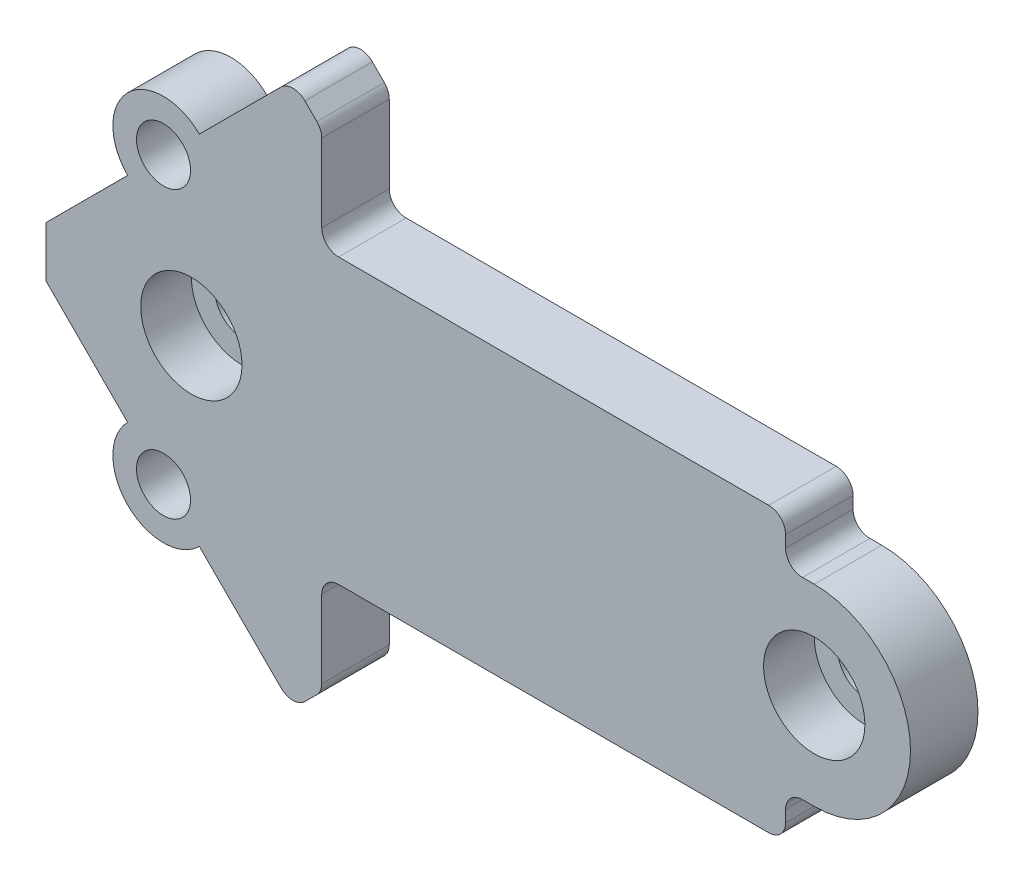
ISO-10303-21;
HEADER;
FILE_DESCRIPTION(('STEP AP214'),'2;1');
FILE_NAME('part.step','',(''),(''),'','','');
FILE_SCHEMA(('AUTOMOTIVE_DESIGN { 1 0 10303 214 1 1 1 1 }'));
ENDSEC;
DATA;
#1=APPLICATION_CONTEXT('core data for automotive mechanical design processes');
#2=APPLICATION_PROTOCOL_DEFINITION('international standard','automotive_design',2000,#1);
#3=PRODUCT_CONTEXT('',#1,'mechanical');
#4=PRODUCT('Part','Part','',(#3));
#5=PRODUCT_RELATED_PRODUCT_CATEGORY('part','',(#4));
#6=PRODUCT_DEFINITION_FORMATION('','',#4);
#7=PRODUCT_DEFINITION_CONTEXT('part definition',#1,'design');
#8=PRODUCT_DEFINITION('design','',#6,#7);
#9=PRODUCT_DEFINITION_SHAPE('','',#8);
#10=(LENGTH_UNIT() NAMED_UNIT(*) SI_UNIT(.MILLI.,.METRE.));
#11=(NAMED_UNIT(*) PLANE_ANGLE_UNIT() SI_UNIT($,.RADIAN.));
#12=(NAMED_UNIT(*) SI_UNIT($,.STERADIAN.) SOLID_ANGLE_UNIT());
#13=UNCERTAINTY_MEASURE_WITH_UNIT(LENGTH_MEASURE(1.E-05),#10,'distance_accuracy_value','');
#14=(GEOMETRIC_REPRESENTATION_CONTEXT(3) GLOBAL_UNCERTAINTY_ASSIGNED_CONTEXT((#13)) GLOBAL_UNIT_ASSIGNED_CONTEXT((#10,
#11,#12)) REPRESENTATION_CONTEXT('',''));
#15=CARTESIAN_POINT('',(0.,0.,0.));
#16=DIRECTION('',(0.,0.,1.));
#17=DIRECTION('',(1.,0.,0.));
#18=AXIS2_PLACEMENT_3D('',#15,#16,#17);
#19=CARTESIAN_POINT('',(36.9,0.,-5.8));
#20=DIRECTION('',(0.,0.,1.));
#21=DIRECTION('',(1.,0.,0.));
#22=AXIS2_PLACEMENT_3D('',#19,#20,#21);
#23=CYLINDRICAL_SURFACE('',#22,1.6);
#24=CARTESIAN_POINT('',(36.9,0.,0.));
#25=DIRECTION('',(0.,0.,1.));
#26=DIRECTION('',(1.,0.,0.));
#27=AXIS2_PLACEMENT_3D('',#24,#25,#26);
#28=CIRCLE('',#27,1.6);
#29=CARTESIAN_POINT('',(38.5,0.,0.));
#30=VERTEX_POINT('',#29);
#31=EDGE_CURVE('E432',#30,#30,#28,.T.);
#32=ORIENTED_EDGE('',*,*,#31,.F.);
#33=EDGE_LOOP('',(#32));
#34=FACE_BOUND('',#33,.T.);
#35=CARTESIAN_POINT('',(36.9,0.,1.));
#36=DIRECTION('',(0.,0.,1.));
#37=DIRECTION('',(1.,0.,0.));
#38=AXIS2_PLACEMENT_3D('',#35,#36,#37);
#39=CIRCLE('',#38,1.6);
#40=CARTESIAN_POINT('',(38.5,0.,1.));
#41=VERTEX_POINT('',#40);
#42=EDGE_CURVE('E188',#41,#41,#39,.F.);
#43=ORIENTED_EDGE('',*,*,#42,.F.);
#44=EDGE_LOOP('',(#43));
#45=FACE_BOUND('',#44,.T.);
#46=ADVANCED_FACE('F184',(#34,#45),#23,.F.);
#47=CARTESIAN_POINT('',(0.,0.,-5.8));
#48=DIRECTION('',(0.,0.,1.));
#49=DIRECTION('',(1.,0.,0.));
#50=AXIS2_PLACEMENT_3D('',#47,#48,#49);
#51=CYLINDRICAL_SURFACE('',#50,1.6);
#52=CARTESIAN_POINT('',(0.,0.,0.));
#53=DIRECTION('',(0.,0.,1.));
#54=DIRECTION('',(1.,0.,0.));
#55=AXIS2_PLACEMENT_3D('',#52,#53,#54);
#56=CIRCLE('',#55,1.6);
#57=CARTESIAN_POINT('',(1.6,0.,0.));
#58=VERTEX_POINT('',#57);
#59=EDGE_CURVE('E388',#58,#58,#56,.T.);
#60=ORIENTED_EDGE('',*,*,#59,.F.);
#61=EDGE_LOOP('',(#60));
#62=FACE_BOUND('',#61,.T.);
#63=CARTESIAN_POINT('',(0.,0.,1.));
#64=DIRECTION('',(0.,0.,1.));
#65=DIRECTION('',(1.,0.,0.));
#66=AXIS2_PLACEMENT_3D('',#63,#64,#65);
#67=CIRCLE('',#66,1.6);
#68=CARTESIAN_POINT('',(1.6,0.,1.));
#69=VERTEX_POINT('',#68);
#70=EDGE_CURVE('E409',#69,#69,#67,.F.);
#71=ORIENTED_EDGE('',*,*,#70,.F.);
#72=EDGE_LOOP('',(#71));
#73=FACE_BOUND('',#72,.T.);
#74=ADVANCED_FACE('F841',(#62,#73),#51,.F.);
#75=CARTESIAN_POINT('',(-1.65,8.45499999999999,-35.4008139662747));
#76=DIRECTION('',(0.,0.,1.));
#77=DIRECTION('',(1.,0.,0.));
#78=AXIS2_PLACEMENT_3D('',#75,#76,#77);
#79=CYLINDRICAL_SURFACE('',#78,1.6);
#80=CARTESIAN_POINT('',(-1.65,8.45499999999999,0.));
#81=DIRECTION('',(0.,0.,1.));
#82=DIRECTION('',(1.,0.,0.));
#83=AXIS2_PLACEMENT_3D('',#80,#81,#82);
#84=CIRCLE('',#83,1.6);
#85=CARTESIAN_POINT('',(-0.0500000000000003,8.45499999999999,0.));
#86=VERTEX_POINT('',#85);
#87=EDGE_CURVE('E550',#86,#86,#84,.F.);
#88=ORIENTED_EDGE('',*,*,#87,.T.);
#89=EDGE_LOOP('',(#88));
#90=FACE_BOUND('',#89,.T.);
#91=CARTESIAN_POINT('',(-1.65,8.45499999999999,4.));
#92=DIRECTION('',(0.,0.,1.));
#93=DIRECTION('',(1.,0.,0.));
#94=AXIS2_PLACEMENT_3D('',#91,#92,#93);
#95=CIRCLE('',#94,1.6);
#96=CARTESIAN_POINT('',(-0.0500000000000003,8.45499999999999,4.));
#97=VERTEX_POINT('',#96);
#98=EDGE_CURVE('E533',#97,#97,#95,.F.);
#99=ORIENTED_EDGE('',*,*,#98,.F.);
#100=EDGE_LOOP('',(#99));
#101=FACE_BOUND('',#100,.T.);
#102=ADVANCED_FACE('F848',(#90,#101),#79,.F.);
#103=CARTESIAN_POINT('',(-1.65,-8.45500000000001,-35.4008139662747));
#104=DIRECTION('',(0.,0.,1.));
#105=DIRECTION('',(1.,0.,0.));
#106=AXIS2_PLACEMENT_3D('',#103,#104,#105);
#107=CYLINDRICAL_SURFACE('',#106,1.6);
#108=CARTESIAN_POINT('',(-1.65,-8.45500000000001,0.));
#109=DIRECTION('',(0.,0.,1.));
#110=DIRECTION('',(1.,0.,0.));
#111=AXIS2_PLACEMENT_3D('',#108,#109,#110);
#112=CIRCLE('',#111,1.6);
#113=CARTESIAN_POINT('',(-0.0499999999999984,-8.45500000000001,0.));
#114=VERTEX_POINT('',#113);
#115=EDGE_CURVE('E554',#114,#114,#112,.F.);
#116=ORIENTED_EDGE('',*,*,#115,.T.);
#117=EDGE_LOOP('',(#116));
#118=FACE_BOUND('',#117,.T.);
#119=CARTESIAN_POINT('',(-1.65,-8.45500000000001,4.));
#120=DIRECTION('',(0.,0.,1.));
#121=DIRECTION('',(1.,0.,0.));
#122=AXIS2_PLACEMENT_3D('',#119,#120,#121);
#123=CIRCLE('',#122,1.6);
#124=CARTESIAN_POINT('',(-0.0499999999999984,-8.45500000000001,4.));
#125=VERTEX_POINT('',#124);
#126=EDGE_CURVE('E529',#125,#125,#123,.F.);
#127=ORIENTED_EDGE('',*,*,#126,.F.);
#128=EDGE_LOOP('',(#127));
#129=FACE_BOUND('',#128,.T.);
#130=ADVANCED_FACE('F837',(#118,#129),#107,.F.);
#131=CARTESIAN_POINT('',(0.,0.,0.));
#132=DIRECTION('',(0.,0.,1.));
#133=DIRECTION('',(1.,0.,0.));
#134=AXIS2_PLACEMENT_3D('',#131,#132,#133);
#135=PLANE('',#134);
#136=ORIENTED_EDGE('',*,*,#59,.T.);
#137=EDGE_LOOP('',(#136));
#138=FACE_BOUND('',#137,.T.);
#139=ORIENTED_EDGE('',*,*,#31,.T.);
#140=EDGE_LOOP('',(#139));
#141=FACE_BOUND('',#140,.T.);
#142=DIRECTION('',(0.,1.,0.));
#143=VECTOR('',#142,1.);
#144=CARTESIAN_POINT('',(35.2,-8.4,0.));
#145=LINE('',#144,#143);
#146=CARTESIAN_POINT('',(35.2,-7.4,0.));
#147=VERTEX_POINT('',#146);
#148=CARTESIAN_POINT('',(35.2,-6.7,0.));
#149=VERTEX_POINT('',#148);
#150=EDGE_CURVE('E652',#147,#149,#145,.T.);
#151=ORIENTED_EDGE('',*,*,#150,.F.);
#152=CARTESIAN_POINT('',(34.2,-7.4,0.));
#153=DIRECTION('',(0.,0.,1.));
#154=DIRECTION('',(1.,0.,0.));
#155=AXIS2_PLACEMENT_3D('',#152,#153,#154);
#156=CIRCLE('',#155,1.);
#157=CARTESIAN_POINT('',(34.2,-8.4,0.));
#158=VERTEX_POINT('',#157);
#159=EDGE_CURVE('E702',#147,#158,#156,.F.);
#160=ORIENTED_EDGE('',*,*,#159,.T.);
#161=DIRECTION('',(1.,0.,0.));
#162=VECTOR('',#161,1.);
#163=CARTESIAN_POINT('',(1.7,-8.4,0.));
#164=LINE('',#163,#162);
#165=CARTESIAN_POINT('',(8.72456617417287,-8.4,0.));
#166=VERTEX_POINT('',#165);
#167=EDGE_CURVE('E648',#166,#158,#164,.T.);
#168=ORIENTED_EDGE('',*,*,#167,.F.);
#169=CARTESIAN_POINT('',(8.72456617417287,-9.4,0.));
#170=DIRECTION('',(0.,0.,1.));
#171=DIRECTION('',(1.,0.,0.));
#172=AXIS2_PLACEMENT_3D('',#169,#170,#171);
#173=CIRCLE('',#172,1.);
#174=CARTESIAN_POINT('',(7.72456617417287,-9.4,0.));
#175=VERTEX_POINT('',#174);
#176=EDGE_CURVE('E392',#166,#175,#173,.T.);
#177=ORIENTED_EDGE('',*,*,#176,.T.);
#178=DIRECTION('',(0.,-1.,0.));
#179=VECTOR('',#178,1.);
#180=CARTESIAN_POINT('',(7.72456617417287,-13.9961386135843,0.));
#181=LINE('',#180,#179);
#182=CARTESIAN_POINT('',(7.72456617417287,-13.9961386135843,0.));
#183=VERTEX_POINT('',#182);
#184=EDGE_CURVE('E537',#175,#183,#181,.T.);
#185=ORIENTED_EDGE('',*,*,#184,.T.);
#186=CARTESIAN_POINT('',(6.72456617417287,-13.9961386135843,0.));
#187=DIRECTION('',(0.,0.,1.));
#188=DIRECTION('',(1.,0.,0.));
#189=AXIS2_PLACEMENT_3D('',#186,#187,#188);
#190=CIRCLE('',#189,1.);
#191=CARTESIAN_POINT('',(7.43192699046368,-14.7029912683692,0.));
#192=VERTEX_POINT('',#191);
#193=EDGE_CURVE('E575',#183,#192,#190,.F.);
#194=ORIENTED_EDGE('',*,*,#193,.T.);
#195=DIRECTION('',(-0.706852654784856,-0.707360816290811,0.));
#196=VECTOR('',#195,1.);
#197=CARTESIAN_POINT('',(6.72507433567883,-15.41035208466,0.));
#198=LINE('',#197,#196);
#199=CARTESIAN_POINT('',(6.72507433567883,-15.41035208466,0.));
#200=VERTEX_POINT('',#199);
#201=EDGE_CURVE('E572',#192,#200,#198,.T.);
#202=ORIENTED_EDGE('',*,*,#201,.T.);
#203=CARTESIAN_POINT('',(6.01771351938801,-14.7034994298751,0.));
#204=DIRECTION('',(0.,0.,1.));
#205=DIRECTION('',(1.,0.,0.));
#206=AXIS2_PLACEMENT_3D('',#203,#204,#205);
#207=CIRCLE('',#206,1.);
#208=CARTESIAN_POINT('',(5.31086086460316,-15.410860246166,0.));
#209=VERTEX_POINT('',#208);
#210=EDGE_CURVE('E569',#200,#209,#207,.F.);
#211=ORIENTED_EDGE('',*,*,#210,.T.);
#212=DIRECTION('',(-0.707360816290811,0.706852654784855,0.));
#213=VECTOR('',#212,1.);
#214=CARTESIAN_POINT('',(0.472082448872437,-10.5755579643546,0.));
#215=LINE('',#214,#213);
#216=CARTESIAN_POINT('',(0.472082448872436,-10.5755579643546,0.));
#217=VERTEX_POINT('',#216);
#218=EDGE_CURVE('E566',#209,#217,#215,.T.);
#219=ORIENTED_EDGE('',*,*,#218,.T.);
#220=CARTESIAN_POINT('',(-1.65,-8.45500000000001,0.));
#221=DIRECTION('',(0.,0.,1.));
#222=DIRECTION('',(1.,0.,0.));
#223=AXIS2_PLACEMENT_3D('',#220,#221,#222);
#224=CIRCLE('',#223,3.);
#225=CARTESIAN_POINT('',(-3.77208244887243,-6.33444203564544,0.));
#226=VERTEX_POINT('',#225);
#227=EDGE_CURVE('E562',#217,#226,#224,.F.);
#228=ORIENTED_EDGE('',*,*,#227,.T.);
#229=DIRECTION('',(-0.707360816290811,0.706852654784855,0.));
#230=VECTOR('',#229,1.);
#231=CARTESIAN_POINT('',(-8.61,-1.50000000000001,0.));
#232=LINE('',#231,#230);
#233=CARTESIAN_POINT('',(-8.61,-1.50000000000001,0.));
#234=VERTEX_POINT('',#233);
#235=EDGE_CURVE('E559',#226,#234,#232,.T.);
#236=ORIENTED_EDGE('',*,*,#235,.T.);
#237=DIRECTION('',(0.,1.,0.));
#238=VECTOR('',#237,1.);
#239=CARTESIAN_POINT('',(-8.61,1.49999999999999,0.));
#240=LINE('',#239,#238);
#241=CARTESIAN_POINT('',(-8.61,1.49999999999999,0.));
#242=VERTEX_POINT('',#241);
#243=EDGE_CURVE('E555',#234,#242,#240,.T.);
#244=ORIENTED_EDGE('',*,*,#243,.T.);
#245=DIRECTION('',(-0.707360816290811,-0.706852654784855,0.));
#246=VECTOR('',#245,1.);
#247=CARTESIAN_POINT('',(-8.61,1.49999999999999,0.));
#248=LINE('',#247,#246);
#249=CARTESIAN_POINT('',(-3.77208244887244,6.33444203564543,0.));
#250=VERTEX_POINT('',#249);
#251=EDGE_CURVE('E558',#250,#242,#248,.T.);
#252=ORIENTED_EDGE('',*,*,#251,.F.);
#253=CARTESIAN_POINT('',(-1.65,8.45499999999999,0.));
#254=DIRECTION('',(0.,0.,1.));
#255=DIRECTION('',(1.,0.,0.));
#256=AXIS2_PLACEMENT_3D('',#253,#254,#255);
#257=CIRCLE('',#256,3.);
#258=CARTESIAN_POINT('',(0.472082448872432,10.5755579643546,0.));
#259=VERTEX_POINT('',#258);
#260=EDGE_CURVE('E593',#250,#259,#257,.F.);
#261=ORIENTED_EDGE('',*,*,#260,.T.);
#262=DIRECTION('',(-0.707360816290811,-0.706852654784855,0.));
#263=VECTOR('',#262,1.);
#264=CARTESIAN_POINT('',(0.472082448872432,10.5755579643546,0.));
#265=LINE('',#264,#263);
#266=CARTESIAN_POINT('',(5.31086086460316,15.4108602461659,0.));
#267=VERTEX_POINT('',#266);
#268=EDGE_CURVE('E589',#267,#259,#265,.T.);
#269=ORIENTED_EDGE('',*,*,#268,.F.);
#270=CARTESIAN_POINT('',(6.01771351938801,14.7034994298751,0.));
#271=DIRECTION('',(0.,0.,1.));
#272=DIRECTION('',(1.,0.,0.));
#273=AXIS2_PLACEMENT_3D('',#270,#271,#272);
#274=CIRCLE('',#273,0.999999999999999);
#275=CARTESIAN_POINT('',(6.72507433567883,15.41035208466,0.));
#276=VERTEX_POINT('',#275);
#277=EDGE_CURVE('E585',#276,#267,#274,.T.);
#278=ORIENTED_EDGE('',*,*,#277,.F.);
#279=DIRECTION('',(-0.706852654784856,0.707360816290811,0.));
#280=VECTOR('',#279,1.);
#281=CARTESIAN_POINT('',(6.72507433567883,15.41035208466,0.));
#282=LINE('',#281,#280);
#283=CARTESIAN_POINT('',(7.43192699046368,14.7029912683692,0.));
#284=VERTEX_POINT('',#283);
#285=EDGE_CURVE('E581',#284,#276,#282,.T.);
#286=ORIENTED_EDGE('',*,*,#285,.F.);
#287=CARTESIAN_POINT('',(6.72456617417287,13.9961386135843,0.));
#288=DIRECTION('',(0.,0.,1.));
#289=DIRECTION('',(1.,0.,0.));
#290=AXIS2_PLACEMENT_3D('',#287,#288,#289);
#291=CIRCLE('',#290,1.);
#292=CARTESIAN_POINT('',(7.72456617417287,13.9961386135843,0.));
#293=VERTEX_POINT('',#292);
#294=EDGE_CURVE('E578',#293,#284,#291,.T.);
#295=ORIENTED_EDGE('',*,*,#294,.F.);
#296=DIRECTION('',(0.,1.,0.));
#297=VECTOR('',#296,1.);
#298=CARTESIAN_POINT('',(7.72456617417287,0.,0.));
#299=LINE('',#298,#297);
#300=CARTESIAN_POINT('',(7.72456617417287,9.4,0.));
#301=VERTEX_POINT('',#300);
#302=EDGE_CURVE('E538',#301,#293,#299,.T.);
#303=ORIENTED_EDGE('',*,*,#302,.F.);
#304=CARTESIAN_POINT('',(8.72456617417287,9.4,0.));
#305=DIRECTION('',(0.,0.,1.));
#306=DIRECTION('',(1.,0.,0.));
#307=AXIS2_PLACEMENT_3D('',#304,#305,#306);
#308=CIRCLE('',#307,1.);
#309=CARTESIAN_POINT('',(8.72456617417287,8.4,0.));
#310=VERTEX_POINT('',#309);
#311=EDGE_CURVE('E194',#301,#310,#308,.T.);
#312=ORIENTED_EDGE('',*,*,#311,.T.);
#313=DIRECTION('',(-1.,0.,0.));
#314=VECTOR('',#313,1.);
#315=CARTESIAN_POINT('',(1.7,8.4,0.));
#316=LINE('',#315,#314);
#317=CARTESIAN_POINT('',(34.2,8.4,0.));
#318=VERTEX_POINT('',#317);
#319=EDGE_CURVE('E671',#318,#310,#316,.T.);
#320=ORIENTED_EDGE('',*,*,#319,.F.);
#321=CARTESIAN_POINT('',(34.2,7.4,0.));
#322=DIRECTION('',(0.,0.,1.));
#323=DIRECTION('',(1.,0.,0.));
#324=AXIS2_PLACEMENT_3D('',#321,#322,#323);
#325=CIRCLE('',#324,1.);
#326=CARTESIAN_POINT('',(35.2,7.4,0.));
#327=VERTEX_POINT('',#326);
#328=EDGE_CURVE('E699',#318,#327,#325,.F.);
#329=ORIENTED_EDGE('',*,*,#328,.T.);
#330=DIRECTION('',(0.,1.,0.));
#331=VECTOR('',#330,1.);
#332=CARTESIAN_POINT('',(35.2,5.7,0.));
#333=LINE('',#332,#331);
#334=CARTESIAN_POINT('',(35.2,6.7,0.));
#335=VERTEX_POINT('',#334);
#336=EDGE_CURVE('E667',#335,#327,#333,.T.);
#337=ORIENTED_EDGE('',*,*,#336,.F.);
#338=CARTESIAN_POINT('',(36.2,6.7,0.));
#339=DIRECTION('',(0.,0.,1.));
#340=DIRECTION('',(1.,0.,0.));
#341=AXIS2_PLACEMENT_3D('',#338,#339,#340);
#342=CIRCLE('',#341,1.);
#343=CARTESIAN_POINT('',(36.2,5.7,0.));
#344=VERTEX_POINT('',#343);
#345=EDGE_CURVE('E405',#335,#344,#342,.T.);
#346=ORIENTED_EDGE('',*,*,#345,.T.);
#347=DIRECTION('',(-1.,0.,0.));
#348=VECTOR('',#347,1.);
#349=CARTESIAN_POINT('',(36.9,5.7,0.));
#350=LINE('',#349,#348);
#351=CARTESIAN_POINT('',(36.9,5.7,0.));
#352=VERTEX_POINT('',#351);
#353=EDGE_CURVE('E663',#352,#344,#350,.T.);
#354=ORIENTED_EDGE('',*,*,#353,.F.);
#355=CARTESIAN_POINT('',(36.9,0.,0.));
#356=DIRECTION('',(0.,0.,1.));
#357=DIRECTION('',(1.,0.,0.));
#358=AXIS2_PLACEMENT_3D('',#355,#356,#357);
#359=CIRCLE('',#358,5.7);
#360=CARTESIAN_POINT('',(36.9,-5.7,0.));
#361=VERTEX_POINT('',#360);
#362=EDGE_CURVE('E659',#361,#352,#359,.T.);
#363=ORIENTED_EDGE('',*,*,#362,.F.);
#364=DIRECTION('',(1.,0.,0.));
#365=VECTOR('',#364,1.);
#366=CARTESIAN_POINT('',(36.9,-5.7,0.));
#367=LINE('',#366,#365);
#368=CARTESIAN_POINT('',(36.2,-5.7,0.));
#369=VERTEX_POINT('',#368);
#370=EDGE_CURVE('E656',#369,#361,#367,.T.);
#371=ORIENTED_EDGE('',*,*,#370,.F.);
#372=CARTESIAN_POINT('',(36.2,-6.7,0.));
#373=DIRECTION('',(0.,0.,1.));
#374=DIRECTION('',(1.,0.,0.));
#375=AXIS2_PLACEMENT_3D('',#372,#373,#374);
#376=CIRCLE('',#375,1.);
#377=EDGE_CURVE('E397',#369,#149,#376,.T.);
#378=ORIENTED_EDGE('',*,*,#377,.T.);
#379=EDGE_LOOP('',(#151,#160,#168,#177,#185,#194,#202,#211,#219,#228,#236,#244,#252,#261,#269,
#278,#286,#295,#303,#312,#320,#329,#337,#346,#354,#363,#371,#378));
#380=FACE_BOUND('',#379,.T.);
#381=ORIENTED_EDGE('',*,*,#115,.F.);
#382=EDGE_LOOP('',(#381));
#383=FACE_BOUND('',#382,.T.);
#384=ORIENTED_EDGE('',*,*,#87,.F.);
#385=EDGE_LOOP('',(#384));
#386=FACE_BOUND('',#385,.T.);
#387=ADVANCED_FACE('F725',(#138,#141,#380,#383,#386),#135,.F.);
#388=CARTESIAN_POINT('',(34.2,7.4,13.8));
#389=DIRECTION('',(0.,0.,-1.));
#390=DIRECTION('',(-1.,0.,0.));
#391=AXIS2_PLACEMENT_3D('',#388,#389,#390);
#392=CYLINDRICAL_SURFACE('',#391,1.);
#393=DIRECTION('',(0.,0.,-1.));
#394=VECTOR('',#393,1.);
#395=CARTESIAN_POINT('',(34.2,8.4,13.8));
#396=LINE('',#395,#394);
#397=CARTESIAN_POINT('',(34.2,8.4,4.));
#398=VERTEX_POINT('',#397);
#399=EDGE_CURVE('E393',#398,#318,#396,.T.);
#400=ORIENTED_EDGE('',*,*,#399,.F.);
#401=CARTESIAN_POINT('',(34.2,7.4,4.));
#402=DIRECTION('',(0.,0.,1.));
#403=DIRECTION('',(1.,0.,0.));
#404=AXIS2_PLACEMENT_3D('',#401,#402,#403);
#405=CIRCLE('',#404,1.);
#406=CARTESIAN_POINT('',(35.2,7.4,4.));
#407=VERTEX_POINT('',#406);
#408=EDGE_CURVE('E446',#398,#407,#405,.F.);
#409=ORIENTED_EDGE('',*,*,#408,.T.);
#410=DIRECTION('',(0.,0.,-1.));
#411=VECTOR('',#410,1.);
#412=CARTESIAN_POINT('',(35.2,7.4,13.8));
#413=LINE('',#412,#411);
#414=EDGE_CURVE('E707',#327,#407,#413,.F.);
#415=ORIENTED_EDGE('',*,*,#414,.F.);
#416=ORIENTED_EDGE('',*,*,#328,.F.);
#417=EDGE_LOOP('',(#400,#409,#415,#416));
#418=FACE_BOUND('',#417,.T.);
#419=ADVANCED_FACE('F829',(#418),#392,.T.);
#420=CARTESIAN_POINT('',(36.2,6.7,13.8));
#421=DIRECTION('',(0.,0.,1.));
#422=DIRECTION('',(1.,0.,0.));
#423=AXIS2_PLACEMENT_3D('',#420,#421,#422);
#424=CYLINDRICAL_SURFACE('',#423,1.);
#425=CARTESIAN_POINT('',(36.2,6.7,4.));
#426=DIRECTION('',(0.,0.,1.));
#427=DIRECTION('',(1.,0.,0.));
#428=AXIS2_PLACEMENT_3D('',#425,#426,#427);
#429=CIRCLE('',#428,1.);
#430=CARTESIAN_POINT('',(36.2,5.7,4.));
#431=VERTEX_POINT('',#430);
#432=CARTESIAN_POINT('',(35.2,6.7,4.));
#433=VERTEX_POINT('',#432);
#434=EDGE_CURVE('E456',#431,#433,#429,.F.);
#435=ORIENTED_EDGE('',*,*,#434,.F.);
#436=DIRECTION('',(0.,0.,-1.));
#437=VECTOR('',#436,1.);
#438=CARTESIAN_POINT('',(36.2,5.7,13.8));
#439=LINE('',#438,#437);
#440=EDGE_CURVE('E714',#344,#431,#439,.F.);
#441=ORIENTED_EDGE('',*,*,#440,.F.);
#442=ORIENTED_EDGE('',*,*,#345,.F.);
#443=DIRECTION('',(0.,0.,-1.));
#444=VECTOR('',#443,1.);
#445=CARTESIAN_POINT('',(35.2,6.7,0.));
#446=LINE('',#445,#444);
#447=EDGE_CURVE('E711',#433,#335,#446,.T.);
#448=ORIENTED_EDGE('',*,*,#447,.F.);
#449=EDGE_LOOP('',(#435,#441,#442,#448));
#450=FACE_BOUND('',#449,.T.);
#451=ADVANCED_FACE('F822',(#450),#424,.F.);
#452=CARTESIAN_POINT('',(35.2,5.7,13.8));
#453=DIRECTION('',(-1.,0.,0.));
#454=DIRECTION('',(0.,0.,1.));
#455=AXIS2_PLACEMENT_3D('',#452,#453,#454);
#456=PLANE('',#455);
#457=DIRECTION('',(0.,1.,0.));
#458=VECTOR('',#457,1.);
#459=CARTESIAN_POINT('',(35.2,5.7,4.));
#460=LINE('',#459,#458);
#461=EDGE_CURVE('E453',#433,#407,#460,.T.);
#462=ORIENTED_EDGE('',*,*,#461,.F.);
#463=ORIENTED_EDGE('',*,*,#447,.T.);
#464=ORIENTED_EDGE('',*,*,#336,.T.);
#465=ORIENTED_EDGE('',*,*,#414,.T.);
#466=EDGE_LOOP('',(#462,#463,#464,#465));
#467=FACE_BOUND('',#466,.T.);
#468=ADVANCED_FACE('F826',(#467),#456,.F.);
#469=CARTESIAN_POINT('',(36.9,5.7,13.8));
#470=DIRECTION('',(0.,-1.,0.));
#471=DIRECTION('',(0.,0.,-1.));
#472=AXIS2_PLACEMENT_3D('',#469,#470,#471);
#473=PLANE('',#472);
#474=DIRECTION('',(-1.,0.,0.));
#475=VECTOR('',#474,1.);
#476=CARTESIAN_POINT('',(36.9,5.7,4.));
#477=LINE('',#476,#475);
#478=CARTESIAN_POINT('',(36.9,5.7,4.));
#479=VERTEX_POINT('',#478);
#480=EDGE_CURVE('E462',#479,#431,#477,.T.);
#481=ORIENTED_EDGE('',*,*,#480,.F.);
#482=DIRECTION('',(0.,0.,-1.));
#483=VECTOR('',#482,1.);
#484=CARTESIAN_POINT('',(36.9,5.7,13.8));
#485=LINE('',#484,#483);
#486=EDGE_CURVE('E675',#479,#352,#485,.T.);
#487=ORIENTED_EDGE('',*,*,#486,.T.);
#488=ORIENTED_EDGE('',*,*,#353,.T.);
#489=ORIENTED_EDGE('',*,*,#440,.T.);
#490=EDGE_LOOP('',(#481,#487,#488,#489));
#491=FACE_BOUND('',#490,.T.);
#492=ADVANCED_FACE('F818',(#491),#473,.F.);
#493=CARTESIAN_POINT('',(36.9,0.,13.8));
#494=DIRECTION('',(0.,0.,-1.));
#495=DIRECTION('',(-1.,0.,0.));
#496=AXIS2_PLACEMENT_3D('',#493,#494,#495);
#497=CYLINDRICAL_SURFACE('',#496,5.7);
#498=CARTESIAN_POINT('',(36.9,0.,4.));
#499=DIRECTION('',(0.,0.,1.));
#500=DIRECTION('',(1.,0.,0.));
#501=AXIS2_PLACEMENT_3D('',#498,#499,#500);
#502=CIRCLE('',#501,5.7);
#503=CARTESIAN_POINT('',(36.9,-5.7,4.));
#504=VERTEX_POINT('',#503);
#505=EDGE_CURVE('E465',#504,#479,#502,.T.);
#506=ORIENTED_EDGE('',*,*,#505,.F.);
#507=DIRECTION('',(0.,0.,-1.));
#508=VECTOR('',#507,1.);
#509=CARTESIAN_POINT('',(36.9,-5.7,13.8));
#510=LINE('',#509,#508);
#511=EDGE_CURVE('E678',#504,#361,#510,.T.);
#512=ORIENTED_EDGE('',*,*,#511,.T.);
#513=ORIENTED_EDGE('',*,*,#362,.T.);
#514=ORIENTED_EDGE('',*,*,#486,.F.);
#515=EDGE_LOOP('',(#506,#512,#513,#514));
#516=FACE_BOUND('',#515,.T.);
#517=ADVANCED_FACE('F812',(#516),#497,.T.);
#518=CARTESIAN_POINT('',(36.2,-6.7,13.8));
#519=DIRECTION('',(0.,0.,1.));
#520=DIRECTION('',(1.,0.,0.));
#521=AXIS2_PLACEMENT_3D('',#518,#519,#520);
#522=CYLINDRICAL_SURFACE('',#521,1.);
#523=CARTESIAN_POINT('',(36.2,-6.7,4.));
#524=DIRECTION('',(0.,0.,1.));
#525=DIRECTION('',(1.,0.,0.));
#526=AXIS2_PLACEMENT_3D('',#523,#524,#525);
#527=CIRCLE('',#526,1.);
#528=CARTESIAN_POINT('',(35.2,-6.7,4.));
#529=VERTEX_POINT('',#528);
#530=CARTESIAN_POINT('',(36.2,-5.7,4.));
#531=VERTEX_POINT('',#530);
#532=EDGE_CURVE('E471',#529,#531,#527,.F.);
#533=ORIENTED_EDGE('',*,*,#532,.F.);
#534=DIRECTION('',(0.,0.,-1.));
#535=VECTOR('',#534,1.);
#536=CARTESIAN_POINT('',(35.2,-6.7,13.8));
#537=LINE('',#536,#535);
#538=EDGE_CURVE('E692',#149,#529,#537,.F.);
#539=ORIENTED_EDGE('',*,*,#538,.F.);
#540=ORIENTED_EDGE('',*,*,#377,.F.);
#541=DIRECTION('',(0.,0.,-1.));
#542=VECTOR('',#541,1.);
#543=CARTESIAN_POINT('',(36.2,-5.7,0.));
#544=LINE('',#543,#542);
#545=EDGE_CURVE('E209',#531,#369,#544,.T.);
#546=ORIENTED_EDGE('',*,*,#545,.F.);
#547=EDGE_LOOP('',(#533,#539,#540,#546));
#548=FACE_BOUND('',#547,.T.);
#549=ADVANCED_FACE('F805',(#548),#522,.F.);
#550=CARTESIAN_POINT('',(36.9,-5.7,13.8));
#551=DIRECTION('',(0.,1.,0.));
#552=DIRECTION('',(0.,0.,1.));
#553=AXIS2_PLACEMENT_3D('',#550,#551,#552);
#554=PLANE('',#553);
#555=DIRECTION('',(1.,0.,0.));
#556=VECTOR('',#555,1.);
#557=CARTESIAN_POINT('',(36.9,-5.7,4.));
#558=LINE('',#557,#556);
#559=EDGE_CURVE('E468',#531,#504,#558,.T.);
#560=ORIENTED_EDGE('',*,*,#559,.F.);
#561=ORIENTED_EDGE('',*,*,#545,.T.);
#562=ORIENTED_EDGE('',*,*,#370,.T.);
#563=ORIENTED_EDGE('',*,*,#511,.F.);
#564=EDGE_LOOP('',(#560,#561,#562,#563));
#565=FACE_BOUND('',#564,.T.);
#566=ADVANCED_FACE('F809',(#565),#554,.F.);
#567=CARTESIAN_POINT('',(34.2,-7.4,13.8));
#568=DIRECTION('',(0.,0.,-1.));
#569=DIRECTION('',(-1.,0.,0.));
#570=AXIS2_PLACEMENT_3D('',#567,#568,#569);
#571=CYLINDRICAL_SURFACE('',#570,1.);
#572=DIRECTION('',(0.,0.,-1.));
#573=VECTOR('',#572,1.);
#574=CARTESIAN_POINT('',(35.2,-7.4,13.8));
#575=LINE('',#574,#573);
#576=CARTESIAN_POINT('',(35.2,-7.4,4.));
#577=VERTEX_POINT('',#576);
#578=EDGE_CURVE('E696',#577,#147,#575,.T.);
#579=ORIENTED_EDGE('',*,*,#578,.F.);
#580=CARTESIAN_POINT('',(34.2,-7.4,4.));
#581=DIRECTION('',(0.,0.,1.));
#582=DIRECTION('',(1.,0.,0.));
#583=AXIS2_PLACEMENT_3D('',#580,#581,#582);
#584=CIRCLE('',#583,1.);
#585=CARTESIAN_POINT('',(34.2,-8.4,4.));
#586=VERTEX_POINT('',#585);
#587=EDGE_CURVE('E480',#577,#586,#584,.F.);
#588=ORIENTED_EDGE('',*,*,#587,.T.);
#589=DIRECTION('',(0.,0.,-1.));
#590=VECTOR('',#589,1.);
#591=CARTESIAN_POINT('',(34.2,-8.4,13.8));
#592=LINE('',#591,#590);
#593=EDGE_CURVE('E685',#158,#586,#592,.F.);
#594=ORIENTED_EDGE('',*,*,#593,.F.);
#595=ORIENTED_EDGE('',*,*,#159,.F.);
#596=EDGE_LOOP('',(#579,#588,#594,#595));
#597=FACE_BOUND('',#596,.T.);
#598=ADVANCED_FACE('F798',(#597),#571,.T.);
#599=CARTESIAN_POINT('',(35.2,-8.4,13.8));
#600=DIRECTION('',(-1.,0.,0.));
#601=DIRECTION('',(0.,0.,1.));
#602=AXIS2_PLACEMENT_3D('',#599,#600,#601);
#603=PLANE('',#602);
#604=DIRECTION('',(0.,1.,0.));
#605=VECTOR('',#604,1.);
#606=CARTESIAN_POINT('',(35.2,-8.4,4.));
#607=LINE('',#606,#605);
#608=EDGE_CURVE('E477',#577,#529,#607,.T.);
#609=ORIENTED_EDGE('',*,*,#608,.F.);
#610=ORIENTED_EDGE('',*,*,#578,.T.);
#611=ORIENTED_EDGE('',*,*,#150,.T.);
#612=ORIENTED_EDGE('',*,*,#538,.T.);
#613=EDGE_LOOP('',(#609,#610,#611,#612));
#614=FACE_BOUND('',#613,.T.);
#615=ADVANCED_FACE('F802',(#614),#603,.F.);
#616=CARTESIAN_POINT('',(-8.61,1.49999999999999,-35.4008139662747));
#617=DIRECTION('',(0.706852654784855,-0.707360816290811,0.));
#618=DIRECTION('',(0.707360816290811,0.706852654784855,0.));
#619=AXIS2_PLACEMENT_3D('',#616,#617,#618);
#620=PLANE('',#619);
#621=DIRECTION('',(-0.707360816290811,-0.706852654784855,0.));
#622=VECTOR('',#621,1.);
#623=CARTESIAN_POINT('',(-8.61,1.49999999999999,4.));
#624=LINE('',#623,#622);
#625=CARTESIAN_POINT('',(-3.77208244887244,6.33444203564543,4.));
#626=VERTEX_POINT('',#625);
#627=CARTESIAN_POINT('',(-8.61,1.49999999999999,4.));
#628=VERTEX_POINT('',#627);
#629=EDGE_CURVE('E498',#626,#628,#624,.T.);
#630=ORIENTED_EDGE('',*,*,#629,.F.);
#631=DIRECTION('',(0.,0.,1.));
#632=VECTOR('',#631,1.);
#633=CARTESIAN_POINT('',(-3.77208244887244,6.33444203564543,-35.4008139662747));
#634=LINE('',#633,#632);
#635=EDGE_CURVE('E563',#250,#626,#634,.T.);
#636=ORIENTED_EDGE('',*,*,#635,.F.);
#637=ORIENTED_EDGE('',*,*,#251,.T.);
#638=DIRECTION('',(0.,0.,1.));
#639=VECTOR('',#638,1.);
#640=CARTESIAN_POINT('',(-8.61,1.49999999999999,-35.4008139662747));
#641=LINE('',#640,#639);
#642=EDGE_CURVE('E541',#242,#628,#641,.T.);
#643=ORIENTED_EDGE('',*,*,#642,.T.);
#644=EDGE_LOOP('',(#630,#636,#637,#643));
#645=FACE_BOUND('',#644,.T.);
#646=ADVANCED_FACE('F751',(#645),#620,.F.);
#647=CARTESIAN_POINT('',(-1.65,8.45499999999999,-35.4008139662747));
#648=DIRECTION('',(0.,0.,1.));
#649=DIRECTION('',(1.,0.,0.));
#650=AXIS2_PLACEMENT_3D('',#647,#648,#649);
#651=CYLINDRICAL_SURFACE('',#650,3.);
#652=ORIENTED_EDGE('',*,*,#635,.T.);
#653=CARTESIAN_POINT('',(-1.65,8.45499999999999,4.));
#654=DIRECTION('',(0.,0.,1.));
#655=DIRECTION('',(1.,0.,0.));
#656=AXIS2_PLACEMENT_3D('',#653,#654,#655);
#657=CIRCLE('',#656,3.);
#658=CARTESIAN_POINT('',(0.472082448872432,10.5755579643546,4.));
#659=VERTEX_POINT('',#658);
#660=EDGE_CURVE('E484',#626,#659,#657,.F.);
#661=ORIENTED_EDGE('',*,*,#660,.T.);
#662=DIRECTION('',(0.,0.,1.));
#663=VECTOR('',#662,1.);
#664=CARTESIAN_POINT('',(0.472082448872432,10.5755579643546,-35.4008139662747));
#665=LINE('',#664,#663);
#666=EDGE_CURVE('E638',#259,#659,#665,.T.);
#667=ORIENTED_EDGE('',*,*,#666,.F.);
#668=ORIENTED_EDGE('',*,*,#260,.F.);
#669=EDGE_LOOP('',(#652,#661,#667,#668));
#670=FACE_BOUND('',#669,.T.);
#671=ADVANCED_FACE('F747',(#670),#651,.T.);
#672=CARTESIAN_POINT('',(0.472082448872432,10.5755579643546,-35.4008139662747));
#673=DIRECTION('',(0.706852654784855,-0.707360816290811,0.));
#674=DIRECTION('',(0.707360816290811,0.706852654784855,0.));
#675=AXIS2_PLACEMENT_3D('',#672,#673,#674);
#676=PLANE('',#675);
#677=DIRECTION('',(-0.707360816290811,-0.706852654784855,0.));
#678=VECTOR('',#677,1.);
#679=CARTESIAN_POINT('',(0.472082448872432,10.5755579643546,4.));
#680=LINE('',#679,#678);
#681=CARTESIAN_POINT('',(5.31086086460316,15.4108602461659,4.));
#682=VERTEX_POINT('',#681);
#683=EDGE_CURVE('E474',#682,#659,#680,.T.);
#684=ORIENTED_EDGE('',*,*,#683,.F.);
#685=DIRECTION('',(0.,0.,1.));
#686=VECTOR('',#685,1.);
#687=CARTESIAN_POINT('',(5.31086086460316,15.4108602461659,-35.4008139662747));
#688=LINE('',#687,#686);
#689=EDGE_CURVE('E634',#267,#682,#688,.T.);
#690=ORIENTED_EDGE('',*,*,#689,.F.);
#691=ORIENTED_EDGE('',*,*,#268,.T.);
#692=ORIENTED_EDGE('',*,*,#666,.T.);
#693=EDGE_LOOP('',(#684,#690,#691,#692));
#694=FACE_BOUND('',#693,.T.);
#695=ADVANCED_FACE('F743',(#694),#676,.F.);
#696=CARTESIAN_POINT('',(6.01771351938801,14.7034994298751,-35.4008139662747));
#697=DIRECTION('',(0.,0.,1.));
#698=DIRECTION('',(1.,0.,0.));
#699=AXIS2_PLACEMENT_3D('',#696,#697,#698);
#700=CYLINDRICAL_SURFACE('',#699,0.999999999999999);
#701=CARTESIAN_POINT('',(6.01771351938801,14.7034994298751,4.));
#702=DIRECTION('',(0.,0.,1.));
#703=DIRECTION('',(1.,0.,0.));
#704=AXIS2_PLACEMENT_3D('',#701,#702,#703);
#705=CIRCLE('',#704,0.999999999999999);
#706=CARTESIAN_POINT('',(6.72507433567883,15.41035208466,4.));
#707=VERTEX_POINT('',#706);
#708=EDGE_CURVE('E459',#707,#682,#705,.T.);
#709=ORIENTED_EDGE('',*,*,#708,.F.);
#710=DIRECTION('',(0.,0.,1.));
#711=VECTOR('',#710,1.);
#712=CARTESIAN_POINT('',(6.72507433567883,15.41035208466,-35.4008139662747));
#713=LINE('',#712,#711);
#714=EDGE_CURVE('E630',#276,#707,#713,.T.);
#715=ORIENTED_EDGE('',*,*,#714,.F.);
#716=ORIENTED_EDGE('',*,*,#277,.T.);
#717=ORIENTED_EDGE('',*,*,#689,.T.);
#718=EDGE_LOOP('',(#709,#715,#716,#717));
#719=FACE_BOUND('',#718,.T.);
#720=ADVANCED_FACE('F739',(#719),#700,.T.);
#721=CARTESIAN_POINT('',(6.72507433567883,15.41035208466,-35.4008139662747));
#722=DIRECTION('',(-0.70736081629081,-0.706852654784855,0.));
#723=DIRECTION('',(0.706852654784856,-0.707360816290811,0.));
#724=AXIS2_PLACEMENT_3D('',#721,#722,#723);
#725=PLANE('',#724);
#726=DIRECTION('',(-0.706852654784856,0.707360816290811,0.));
#727=VECTOR('',#726,1.);
#728=CARTESIAN_POINT('',(6.72507433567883,15.41035208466,4.));
#729=LINE('',#728,#727);
#730=CARTESIAN_POINT('',(7.43192699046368,14.7029912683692,4.));
#731=VERTEX_POINT('',#730);
#732=EDGE_CURVE('E450',#731,#707,#729,.T.);
#733=ORIENTED_EDGE('',*,*,#732,.F.);
#734=DIRECTION('',(0.,0.,1.));
#735=VECTOR('',#734,1.);
#736=CARTESIAN_POINT('',(7.43192699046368,14.7029912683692,-35.4008139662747));
#737=LINE('',#736,#735);
#738=EDGE_CURVE('E626',#284,#731,#737,.T.);
#739=ORIENTED_EDGE('',*,*,#738,.F.);
#740=ORIENTED_EDGE('',*,*,#285,.T.);
#741=ORIENTED_EDGE('',*,*,#714,.T.);
#742=EDGE_LOOP('',(#733,#739,#740,#741));
#743=FACE_BOUND('',#742,.T.);
#744=ADVANCED_FACE('F736',(#743),#725,.F.);
#745=CARTESIAN_POINT('',(8.72456617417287,-9.4,-7.62925635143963));
#746=DIRECTION('',(0.,0.,1.));
#747=DIRECTION('',(1.,0.,0.));
#748=AXIS2_PLACEMENT_3D('',#745,#746,#747);
#749=CYLINDRICAL_SURFACE('',#748,1.);
#750=CARTESIAN_POINT('',(8.72456617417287,-9.4,4.));
#751=DIRECTION('',(0.,0.,1.));
#752=DIRECTION('',(1.,0.,0.));
#753=AXIS2_PLACEMENT_3D('',#750,#751,#752);
#754=CIRCLE('',#753,1.);
#755=CARTESIAN_POINT('',(7.72456617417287,-9.4,4.));
#756=VERTEX_POINT('',#755);
#757=CARTESIAN_POINT('',(8.72456617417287,-8.4,4.));
#758=VERTEX_POINT('',#757);
#759=EDGE_CURVE('E491',#756,#758,#754,.F.);
#760=ORIENTED_EDGE('',*,*,#759,.F.);
#761=DIRECTION('',(0.,0.,1.));
#762=VECTOR('',#761,1.);
#763=CARTESIAN_POINT('',(7.72456617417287,-9.4,-7.62925635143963));
#764=LINE('',#763,#762);
#765=EDGE_CURVE('E681',#175,#756,#764,.T.);
#766=ORIENTED_EDGE('',*,*,#765,.F.);
#767=ORIENTED_EDGE('',*,*,#176,.F.);
#768=DIRECTION('',(0.,0.,1.));
#769=VECTOR('',#768,1.);
#770=CARTESIAN_POINT('',(8.72456617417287,-8.4,13.8));
#771=LINE('',#770,#769);
#772=EDGE_CURVE('E689',#758,#166,#771,.F.);
#773=ORIENTED_EDGE('',*,*,#772,.F.);
#774=EDGE_LOOP('',(#760,#766,#767,#773));
#775=FACE_BOUND('',#774,.T.);
#776=ADVANCED_FACE('F788',(#775),#749,.F.);
#777=CARTESIAN_POINT('',(7.72456617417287,-13.9961386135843,-7.62925635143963));
#778=DIRECTION('',(1.,0.,0.));
#779=DIRECTION('',(0.,1.,0.));
#780=AXIS2_PLACEMENT_3D('',#777,#778,#779);
#781=PLANE('',#780);
#782=ORIENTED_EDGE('',*,*,#765,.T.);
#783=DIRECTION('',(0.,-1.,0.));
#784=VECTOR('',#783,1.);
#785=CARTESIAN_POINT('',(7.72456617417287,-13.9961386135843,4.));
#786=LINE('',#785,#784);
#787=CARTESIAN_POINT('',(7.72456617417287,-13.9961386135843,4.));
#788=VERTEX_POINT('',#787);
#789=EDGE_CURVE('E494',#756,#788,#786,.T.);
#790=ORIENTED_EDGE('',*,*,#789,.T.);
#791=DIRECTION('',(0.,0.,1.));
#792=VECTOR('',#791,1.);
#793=CARTESIAN_POINT('',(7.72456617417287,-13.9961386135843,-7.62925635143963));
#794=LINE('',#793,#792);
#795=EDGE_CURVE('E544',#183,#788,#794,.T.);
#796=ORIENTED_EDGE('',*,*,#795,.F.);
#797=ORIENTED_EDGE('',*,*,#184,.F.);
#798=EDGE_LOOP('',(#782,#790,#796,#797));
#799=FACE_BOUND('',#798,.T.);
#800=ADVANCED_FACE('F783',(#799),#781,.T.);
#801=CARTESIAN_POINT('',(6.72456617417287,-13.9961386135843,-35.4008139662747));
#802=DIRECTION('',(0.,0.,1.));
#803=DIRECTION('',(1.,0.,0.));
#804=AXIS2_PLACEMENT_3D('',#801,#802,#803);
#805=CYLINDRICAL_SURFACE('',#804,1.);
#806=ORIENTED_EDGE('',*,*,#795,.T.);
#807=CARTESIAN_POINT('',(6.72456617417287,-13.9961386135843,4.));
#808=DIRECTION('',(0.,0.,1.));
#809=DIRECTION('',(1.,0.,0.));
#810=AXIS2_PLACEMENT_3D('',#807,#808,#809);
#811=CIRCLE('',#810,1.);
#812=CARTESIAN_POINT('',(7.43192699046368,-14.7029912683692,4.));
#813=VERTEX_POINT('',#812);
#814=EDGE_CURVE('E501',#788,#813,#811,.F.);
#815=ORIENTED_EDGE('',*,*,#814,.T.);
#816=DIRECTION('',(0.,0.,1.));
#817=VECTOR('',#816,1.);
#818=CARTESIAN_POINT('',(7.43192699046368,-14.7029912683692,-35.4008139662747));
#819=LINE('',#818,#817);
#820=EDGE_CURVE('E622',#192,#813,#819,.T.);
#821=ORIENTED_EDGE('',*,*,#820,.F.);
#822=ORIENTED_EDGE('',*,*,#193,.F.);
#823=EDGE_LOOP('',(#806,#815,#821,#822));
#824=FACE_BOUND('',#823,.T.);
#825=ADVANCED_FACE('F779',(#824),#805,.T.);
#826=CARTESIAN_POINT('',(6.72507433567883,-15.41035208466,-35.4008139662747));
#827=DIRECTION('',(0.70736081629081,-0.706852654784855,0.));
#828=DIRECTION('',(0.706852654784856,0.707360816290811,0.));
#829=AXIS2_PLACEMENT_3D('',#826,#827,#828);
#830=PLANE('',#829);
#831=ORIENTED_EDGE('',*,*,#820,.T.);
#832=DIRECTION('',(-0.706852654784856,-0.707360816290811,0.));
#833=VECTOR('',#832,1.);
#834=CARTESIAN_POINT('',(6.72507433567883,-15.41035208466,4.));
#835=LINE('',#834,#833);
#836=CARTESIAN_POINT('',(6.72507433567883,-15.41035208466,4.));
#837=VERTEX_POINT('',#836);
#838=EDGE_CURVE('E505',#813,#837,#835,.T.);
#839=ORIENTED_EDGE('',*,*,#838,.T.);
#840=DIRECTION('',(0.,0.,1.));
#841=VECTOR('',#840,1.);
#842=CARTESIAN_POINT('',(6.72507433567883,-15.41035208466,-35.4008139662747));
#843=LINE('',#842,#841);
#844=EDGE_CURVE('E618',#200,#837,#843,.T.);
#845=ORIENTED_EDGE('',*,*,#844,.F.);
#846=ORIENTED_EDGE('',*,*,#201,.F.);
#847=EDGE_LOOP('',(#831,#839,#845,#846));
#848=FACE_BOUND('',#847,.T.);
#849=ADVANCED_FACE('F774',(#848),#830,.T.);
#850=CARTESIAN_POINT('',(6.01771351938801,-14.7034994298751,-35.4008139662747));
#851=DIRECTION('',(0.,0.,1.));
#852=DIRECTION('',(1.,0.,0.));
#853=AXIS2_PLACEMENT_3D('',#850,#851,#852);
#854=CYLINDRICAL_SURFACE('',#853,1.);
#855=ORIENTED_EDGE('',*,*,#844,.T.);
#856=CARTESIAN_POINT('',(6.01771351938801,-14.7034994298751,4.));
#857=DIRECTION('',(0.,0.,1.));
#858=DIRECTION('',(1.,0.,0.));
#859=AXIS2_PLACEMENT_3D('',#856,#857,#858);
#860=CIRCLE('',#859,1.);
#861=CARTESIAN_POINT('',(5.31086086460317,-15.410860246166,4.));
#862=VERTEX_POINT('',#861);
#863=EDGE_CURVE('E509',#837,#862,#860,.F.);
#864=ORIENTED_EDGE('',*,*,#863,.T.);
#865=DIRECTION('',(0.,0.,1.));
#866=VECTOR('',#865,1.);
#867=CARTESIAN_POINT('',(5.31086086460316,-15.410860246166,-35.4008139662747));
#868=LINE('',#867,#866);
#869=EDGE_CURVE('E614',#209,#862,#868,.T.);
#870=ORIENTED_EDGE('',*,*,#869,.F.);
#871=ORIENTED_EDGE('',*,*,#210,.F.);
#872=EDGE_LOOP('',(#855,#864,#870,#871));
#873=FACE_BOUND('',#872,.T.);
#874=ADVANCED_FACE('F771',(#873),#854,.T.);
#875=CARTESIAN_POINT('',(0.472082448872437,-10.5755579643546,-35.4008139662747));
#876=DIRECTION('',(-0.706852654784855,-0.707360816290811,0.));
#877=DIRECTION('',(0.707360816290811,-0.706852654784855,0.));
#878=AXIS2_PLACEMENT_3D('',#875,#876,#877);
#879=PLANE('',#878);
#880=ORIENTED_EDGE('',*,*,#869,.T.);
#881=DIRECTION('',(-0.707360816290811,0.706852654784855,0.));
#882=VECTOR('',#881,1.);
#883=CARTESIAN_POINT('',(0.472082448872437,-10.5755579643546,4.));
#884=LINE('',#883,#882);
#885=CARTESIAN_POINT('',(0.472082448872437,-10.5755579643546,4.));
#886=VERTEX_POINT('',#885);
#887=EDGE_CURVE('E513',#862,#886,#884,.T.);
#888=ORIENTED_EDGE('',*,*,#887,.T.);
#889=DIRECTION('',(0.,0.,1.));
#890=VECTOR('',#889,1.);
#891=CARTESIAN_POINT('',(0.472082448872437,-10.5755579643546,-35.4008139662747));
#892=LINE('',#891,#890);
#893=EDGE_CURVE('E610',#217,#886,#892,.T.);
#894=ORIENTED_EDGE('',*,*,#893,.F.);
#895=ORIENTED_EDGE('',*,*,#218,.F.);
#896=EDGE_LOOP('',(#880,#888,#894,#895));
#897=FACE_BOUND('',#896,.T.);
#898=ADVANCED_FACE('F766',(#897),#879,.T.);
#899=CARTESIAN_POINT('',(-1.65,-8.45500000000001,-35.4008139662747));
#900=DIRECTION('',(0.,0.,1.));
#901=DIRECTION('',(1.,0.,0.));
#902=AXIS2_PLACEMENT_3D('',#899,#900,#901);
#903=CYLINDRICAL_SURFACE('',#902,3.);
#904=ORIENTED_EDGE('',*,*,#893,.T.);
#905=CARTESIAN_POINT('',(-1.65,-8.45500000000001,4.));
#906=DIRECTION('',(0.,0.,1.));
#907=DIRECTION('',(1.,0.,0.));
#908=AXIS2_PLACEMENT_3D('',#905,#906,#907);
#909=CIRCLE('',#908,3.);
#910=CARTESIAN_POINT('',(-3.77208244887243,-6.33444203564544,4.));
#911=VERTEX_POINT('',#910);
#912=EDGE_CURVE('E517',#886,#911,#909,.F.);
#913=ORIENTED_EDGE('',*,*,#912,.T.);
#914=DIRECTION('',(0.,0.,1.));
#915=VECTOR('',#914,1.);
#916=CARTESIAN_POINT('',(-3.77208244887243,-6.33444203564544,-35.4008139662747));
#917=LINE('',#916,#915);
#918=EDGE_CURVE('E606',#226,#911,#917,.T.);
#919=ORIENTED_EDGE('',*,*,#918,.F.);
#920=ORIENTED_EDGE('',*,*,#227,.F.);
#921=EDGE_LOOP('',(#904,#913,#919,#920));
#922=FACE_BOUND('',#921,.T.);
#923=ADVANCED_FACE('F763',(#922),#903,.T.);
#924=CARTESIAN_POINT('',(-8.61,-1.50000000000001,-35.4008139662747));
#925=DIRECTION('',(-0.706852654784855,-0.707360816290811,0.));
#926=DIRECTION('',(0.707360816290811,-0.706852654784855,0.));
#927=AXIS2_PLACEMENT_3D('',#924,#925,#926);
#928=PLANE('',#927);
#929=ORIENTED_EDGE('',*,*,#918,.T.);
#930=DIRECTION('',(-0.707360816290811,0.706852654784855,0.));
#931=VECTOR('',#930,1.);
#932=CARTESIAN_POINT('',(-8.61,-1.50000000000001,4.));
#933=LINE('',#932,#931);
#934=CARTESIAN_POINT('',(-8.61,-1.50000000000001,4.));
#935=VERTEX_POINT('',#934);
#936=EDGE_CURVE('E521',#911,#935,#933,.T.);
#937=ORIENTED_EDGE('',*,*,#936,.T.);
#938=DIRECTION('',(0.,0.,1.));
#939=VECTOR('',#938,1.);
#940=CARTESIAN_POINT('',(-8.61,-1.50000000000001,-35.4008139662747));
#941=LINE('',#940,#939);
#942=EDGE_CURVE('E602',#234,#935,#941,.T.);
#943=ORIENTED_EDGE('',*,*,#942,.F.);
#944=ORIENTED_EDGE('',*,*,#235,.F.);
#945=EDGE_LOOP('',(#929,#937,#943,#944));
#946=FACE_BOUND('',#945,.T.);
#947=ADVANCED_FACE('F758',(#946),#928,.T.);
#948=CARTESIAN_POINT('',(-8.61,1.49999999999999,-35.4008139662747));
#949=DIRECTION('',(-1.,0.,0.));
#950=DIRECTION('',(0.,0.,1.));
#951=AXIS2_PLACEMENT_3D('',#948,#949,#950);
#952=PLANE('',#951);
#953=ORIENTED_EDGE('',*,*,#942,.T.);
#954=DIRECTION('',(0.,1.,0.));
#955=VECTOR('',#954,1.);
#956=CARTESIAN_POINT('',(-8.61,1.49999999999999,4.));
#957=LINE('',#956,#955);
#958=EDGE_CURVE('E525',#935,#628,#957,.T.);
#959=ORIENTED_EDGE('',*,*,#958,.T.);
#960=ORIENTED_EDGE('',*,*,#642,.F.);
#961=ORIENTED_EDGE('',*,*,#243,.F.);
#962=EDGE_LOOP('',(#953,#959,#960,#961));
#963=FACE_BOUND('',#962,.T.);
#964=ADVANCED_FACE('F755',(#963),#952,.T.);
#965=CARTESIAN_POINT('',(1.7,-8.4,13.8));
#966=DIRECTION('',(0.,1.,0.));
#967=DIRECTION('',(0.,0.,1.));
#968=AXIS2_PLACEMENT_3D('',#965,#966,#967);
#969=PLANE('',#968);
#970=DIRECTION('',(1.,0.,0.));
#971=VECTOR('',#970,1.);
#972=CARTESIAN_POINT('',(1.7,-8.4,4.));
#973=LINE('',#972,#971);
#974=EDGE_CURVE('E488',#758,#586,#973,.T.);
#975=ORIENTED_EDGE('',*,*,#974,.F.);
#976=ORIENTED_EDGE('',*,*,#772,.T.);
#977=ORIENTED_EDGE('',*,*,#167,.T.);
#978=ORIENTED_EDGE('',*,*,#593,.T.);
#979=EDGE_LOOP('',(#975,#976,#977,#978));
#980=FACE_BOUND('',#979,.T.);
#981=ADVANCED_FACE('F792',(#980),#969,.F.);
#982=CARTESIAN_POINT('',(8.72456617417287,9.4,13.8));
#983=DIRECTION('',(0.,0.,-1.));
#984=DIRECTION('',(-1.,0.,0.));
#985=AXIS2_PLACEMENT_3D('',#982,#983,#984);
#986=CYLINDRICAL_SURFACE('',#985,1.);
#987=CARTESIAN_POINT('',(8.72456617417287,9.4,4.));
#988=DIRECTION('',(0.,0.,1.));
#989=DIRECTION('',(1.,0.,0.));
#990=AXIS2_PLACEMENT_3D('',#987,#988,#989);
#991=CIRCLE('',#990,1.);
#992=CARTESIAN_POINT('',(8.72456617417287,8.4,4.));
#993=VERTEX_POINT('',#992);
#994=CARTESIAN_POINT('',(7.72456617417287,9.4,4.));
#995=VERTEX_POINT('',#994);
#996=EDGE_CURVE('E12',#993,#995,#991,.F.);
#997=ORIENTED_EDGE('',*,*,#996,.F.);
#998=DIRECTION('',(0.,0.,1.));
#999=VECTOR('',#998,1.);
#1000=CARTESIAN_POINT('',(8.72456617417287,8.4,13.8));
#1001=LINE('',#1000,#999);
#1002=EDGE_CURVE('E399',#310,#993,#1001,.T.);
#1003=ORIENTED_EDGE('',*,*,#1002,.F.);
#1004=ORIENTED_EDGE('',*,*,#311,.F.);
#1005=DIRECTION('',(0.,0.,1.));
#1006=VECTOR('',#1005,1.);
#1007=CARTESIAN_POINT('',(7.72456617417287,9.4,0.));
#1008=LINE('',#1007,#1006);
#1009=EDGE_CURVE('E382',#995,#301,#1008,.F.);
#1010=ORIENTED_EDGE('',*,*,#1009,.F.);
#1011=EDGE_LOOP('',(#997,#1003,#1004,#1010));
#1012=FACE_BOUND('',#1011,.T.);
#1013=ADVANCED_FACE('F186',(#1012),#986,.F.);
#1014=CARTESIAN_POINT('',(7.72456617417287,0.,-7.62925635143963));
#1015=DIRECTION('',(-1.,0.,0.));
#1016=DIRECTION('',(0.,-1.,0.));
#1017=AXIS2_PLACEMENT_3D('',#1014,#1015,#1016);
#1018=PLANE('',#1017);
#1019=DIRECTION('',(0.,1.,0.));
#1020=VECTOR('',#1019,1.);
#1021=CARTESIAN_POINT('',(7.72456617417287,0.,4.));
#1022=LINE('',#1021,#1020);
#1023=CARTESIAN_POINT('',(7.72456617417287,13.9961386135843,4.));
#1024=VERTEX_POINT('',#1023);
#1025=EDGE_CURVE('E373',#995,#1024,#1022,.T.);
#1026=ORIENTED_EDGE('',*,*,#1025,.F.);
#1027=ORIENTED_EDGE('',*,*,#1009,.T.);
#1028=ORIENTED_EDGE('',*,*,#302,.T.);
#1029=DIRECTION('',(0.,0.,1.));
#1030=VECTOR('',#1029,1.);
#1031=CARTESIAN_POINT('',(7.72456617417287,13.9961386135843,-7.62925635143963));
#1032=LINE('',#1031,#1030);
#1033=EDGE_CURVE('E385',#293,#1024,#1032,.T.);
#1034=ORIENTED_EDGE('',*,*,#1033,.T.);
#1035=EDGE_LOOP('',(#1026,#1027,#1028,#1034));
#1036=FACE_BOUND('',#1035,.T.);
#1037=ADVANCED_FACE('F381',(#1036),#1018,.F.);
#1038=CARTESIAN_POINT('',(6.72456617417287,13.9961386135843,-35.4008139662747));
#1039=DIRECTION('',(0.,0.,1.));
#1040=DIRECTION('',(1.,0.,0.));
#1041=AXIS2_PLACEMENT_3D('',#1038,#1039,#1040);
#1042=CYLINDRICAL_SURFACE('',#1041,1.);
#1043=CARTESIAN_POINT('',(6.72456617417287,13.9961386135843,4.));
#1044=DIRECTION('',(0.,0.,1.));
#1045=DIRECTION('',(1.,0.,0.));
#1046=AXIS2_PLACEMENT_3D('',#1043,#1044,#1045);
#1047=CIRCLE('',#1046,1.);
#1048=EDGE_CURVE('E387',#1024,#731,#1047,.T.);
#1049=ORIENTED_EDGE('',*,*,#1048,.F.);
#1050=ORIENTED_EDGE('',*,*,#1033,.F.);
#1051=ORIENTED_EDGE('',*,*,#294,.T.);
#1052=ORIENTED_EDGE('',*,*,#738,.T.);
#1053=EDGE_LOOP('',(#1049,#1050,#1051,#1052));
#1054=FACE_BOUND('',#1053,.T.);
#1055=ADVANCED_FACE('F732',(#1054),#1042,.T.);
#1056=CARTESIAN_POINT('',(1.7,8.4,13.8));
#1057=DIRECTION('',(0.,-1.,0.));
#1058=DIRECTION('',(0.,0.,-1.));
#1059=AXIS2_PLACEMENT_3D('',#1056,#1057,#1058);
#1060=PLANE('',#1059);
#1061=DIRECTION('',(-1.,0.,0.));
#1062=VECTOR('',#1061,1.);
#1063=CARTESIAN_POINT('',(1.7,8.4,4.));
#1064=LINE('',#1063,#1062);
#1065=EDGE_CURVE('E201',#398,#993,#1064,.T.);
#1066=ORIENTED_EDGE('',*,*,#1065,.F.);
#1067=ORIENTED_EDGE('',*,*,#399,.T.);
#1068=ORIENTED_EDGE('',*,*,#319,.T.);
#1069=ORIENTED_EDGE('',*,*,#1002,.T.);
#1070=EDGE_LOOP('',(#1066,#1067,#1068,#1069));
#1071=FACE_BOUND('',#1070,.T.);
#1072=ADVANCED_FACE('F719',(#1071),#1060,.F.);
#1073=CARTESIAN_POINT('',(0.,0.,4.));
#1074=DIRECTION('',(0.,0.,1.));
#1075=DIRECTION('',(1.,0.,0.));
#1076=AXIS2_PLACEMENT_3D('',#1073,#1074,#1075);
#1077=PLANE('',#1076);
#1078=CARTESIAN_POINT('',(0.,0.,4.));
#1079=DIRECTION('',(0.,0.,1.));
#1080=DIRECTION('',(1.,0.,0.));
#1081=AXIS2_PLACEMENT_3D('',#1078,#1079,#1080);
#1082=CIRCLE('',#1081,3.);
#1083=CARTESIAN_POINT('',(3.,0.,4.));
#1084=VERTEX_POINT('',#1083);
#1085=EDGE_CURVE('E428',#1084,#1084,#1082,.T.);
#1086=ORIENTED_EDGE('',*,*,#1085,.F.);
#1087=EDGE_LOOP('',(#1086));
#1088=FACE_BOUND('',#1087,.T.);
#1089=CARTESIAN_POINT('',(36.9,0.,4.));
#1090=DIRECTION('',(0.,0.,1.));
#1091=DIRECTION('',(1.,0.,0.));
#1092=AXIS2_PLACEMENT_3D('',#1089,#1090,#1091);
#1093=CIRCLE('',#1092,3.);
#1094=CARTESIAN_POINT('',(39.9,0.,4.));
#1095=VERTEX_POINT('',#1094);
#1096=EDGE_CURVE('E418',#1095,#1095,#1093,.T.);
#1097=ORIENTED_EDGE('',*,*,#1096,.F.);
#1098=EDGE_LOOP('',(#1097));
#1099=FACE_BOUND('',#1098,.T.);
#1100=ORIENTED_EDGE('',*,*,#936,.F.);
#1101=ORIENTED_EDGE('',*,*,#912,.F.);
#1102=ORIENTED_EDGE('',*,*,#887,.F.);
#1103=ORIENTED_EDGE('',*,*,#863,.F.);
#1104=ORIENTED_EDGE('',*,*,#838,.F.);
#1105=ORIENTED_EDGE('',*,*,#814,.F.);
#1106=ORIENTED_EDGE('',*,*,#789,.F.);
#1107=ORIENTED_EDGE('',*,*,#759,.T.);
#1108=ORIENTED_EDGE('',*,*,#974,.T.);
#1109=ORIENTED_EDGE('',*,*,#587,.F.);
#1110=ORIENTED_EDGE('',*,*,#608,.T.);
#1111=ORIENTED_EDGE('',*,*,#532,.T.);
#1112=ORIENTED_EDGE('',*,*,#559,.T.);
#1113=ORIENTED_EDGE('',*,*,#505,.T.);
#1114=ORIENTED_EDGE('',*,*,#480,.T.);
#1115=ORIENTED_EDGE('',*,*,#434,.T.);
#1116=ORIENTED_EDGE('',*,*,#461,.T.);
#1117=ORIENTED_EDGE('',*,*,#408,.F.);
#1118=ORIENTED_EDGE('',*,*,#1065,.T.);
#1119=ORIENTED_EDGE('',*,*,#996,.T.);
#1120=ORIENTED_EDGE('',*,*,#1025,.T.);
#1121=ORIENTED_EDGE('',*,*,#1048,.T.);
#1122=ORIENTED_EDGE('',*,*,#732,.T.);
#1123=ORIENTED_EDGE('',*,*,#708,.T.);
#1124=ORIENTED_EDGE('',*,*,#683,.T.);
#1125=ORIENTED_EDGE('',*,*,#660,.F.);
#1126=ORIENTED_EDGE('',*,*,#629,.T.);
#1127=ORIENTED_EDGE('',*,*,#958,.F.);
#1128=EDGE_LOOP('',(#1100,#1101,#1102,#1103,#1104,#1105,#1106,#1107,#1108,#1109,#1110,#1111,
#1112,#1113,#1114,#1115,#1116,#1117,#1118,#1119,#1120,#1121,#1122,#1123,#1124,#1125,#1126,#1127));
#1129=FACE_BOUND('',#1128,.T.);
#1130=ORIENTED_EDGE('',*,*,#126,.T.);
#1131=EDGE_LOOP('',(#1130));
#1132=FACE_BOUND('',#1131,.T.);
#1133=ORIENTED_EDGE('',*,*,#98,.T.);
#1134=EDGE_LOOP('',(#1133));
#1135=FACE_BOUND('',#1134,.T.);
#1136=ADVANCED_FACE('F371',(#1088,#1099,#1129,#1132,#1135),#1077,.T.);
#1137=CARTESIAN_POINT('',(0.,0.,2.));
#1138=DIRECTION('',(0.,0.,1.));
#1139=DIRECTION('',(1.,0.,0.));
#1140=AXIS2_PLACEMENT_3D('',#1137,#1138,#1139);
#1141=CYLINDRICAL_SURFACE('',#1140,3.);
#1142=ORIENTED_EDGE('',*,*,#1085,.T.);
#1143=EDGE_LOOP('',(#1142));
#1144=FACE_BOUND('',#1143,.T.);
#1145=CARTESIAN_POINT('',(0.,0.,1.));
#1146=DIRECTION('',(0.,0.,1.));
#1147=DIRECTION('',(1.,0.,0.));
#1148=AXIS2_PLACEMENT_3D('',#1145,#1146,#1147);
#1149=CIRCLE('',#1148,3.);
#1150=CARTESIAN_POINT('',(3.,0.,1.));
#1151=VERTEX_POINT('',#1150);
#1152=EDGE_CURVE('E412',#1151,#1151,#1149,.T.);
#1153=ORIENTED_EDGE('',*,*,#1152,.F.);
#1154=EDGE_LOOP('',(#1153));
#1155=FACE_BOUND('',#1154,.T.);
#1156=ADVANCED_FACE('F856',(#1144,#1155),#1141,.F.);
#1157=CARTESIAN_POINT('',(36.9,0.,2.));
#1158=DIRECTION('',(0.,0.,1.));
#1159=DIRECTION('',(1.,0.,0.));
#1160=AXIS2_PLACEMENT_3D('',#1157,#1158,#1159);
#1161=CYLINDRICAL_SURFACE('',#1160,3.);
#1162=ORIENTED_EDGE('',*,*,#1096,.T.);
#1163=EDGE_LOOP('',(#1162));
#1164=FACE_BOUND('',#1163,.T.);
#1165=CARTESIAN_POINT('',(36.9,0.,1.));
#1166=DIRECTION('',(0.,0.,1.));
#1167=DIRECTION('',(1.,0.,0.));
#1168=AXIS2_PLACEMENT_3D('',#1165,#1166,#1167);
#1169=CIRCLE('',#1168,3.);
#1170=CARTESIAN_POINT('',(39.9,0.,1.));
#1171=VERTEX_POINT('',#1170);
#1172=EDGE_CURVE('E420',#1171,#1171,#1169,.T.);
#1173=ORIENTED_EDGE('',*,*,#1172,.F.);
#1174=EDGE_LOOP('',(#1173));
#1175=FACE_BOUND('',#1174,.T.);
#1176=ADVANCED_FACE('F1033',(#1164,#1175),#1161,.F.);
#1177=CARTESIAN_POINT('',(36.9,0.,1.));
#1178=DIRECTION('',(0.,0.,1.));
#1179=DIRECTION('',(1.,0.,0.));
#1180=AXIS2_PLACEMENT_3D('',#1177,#1178,#1179);
#1181=PLANE('',#1180);
#1182=ORIENTED_EDGE('',*,*,#1172,.T.);
#1183=EDGE_LOOP('',(#1182));
#1184=FACE_BOUND('',#1183,.T.);
#1185=ORIENTED_EDGE('',*,*,#42,.T.);
#1186=EDGE_LOOP('',(#1185));
#1187=FACE_BOUND('',#1186,.T.);
#1188=ADVANCED_FACE('F1045',(#1184,#1187),#1181,.T.);
#1189=CARTESIAN_POINT('',(0.,0.,1.));
#1190=DIRECTION('',(0.,0.,1.));
#1191=DIRECTION('',(1.,0.,0.));
#1192=AXIS2_PLACEMENT_3D('',#1189,#1190,#1191);
#1193=PLANE('',#1192);
#1194=ORIENTED_EDGE('',*,*,#1152,.T.);
#1195=EDGE_LOOP('',(#1194));
#1196=FACE_BOUND('',#1195,.T.);
#1197=ORIENTED_EDGE('',*,*,#70,.T.);
#1198=EDGE_LOOP('',(#1197));
#1199=FACE_BOUND('',#1198,.T.);
#1200=ADVANCED_FACE('F1064',(#1196,#1199),#1193,.T.);
#1201=CLOSED_SHELL('',(#46,#74,#102,#130,#387,#419,#451,#468,#492,#517,#549,#566,#598,#615,#646,
#671,#695,#720,#744,#776,#800,#825,#849,#874,#898,#923,#947,#964,#981,#1013,#1037,#1055,#1072,
#1136,#1156,#1176,#1188,#1200));
#1202=MANIFOLD_SOLID_BREP('B2',#1201);
#1203=ADVANCED_BREP_SHAPE_REPRESENTATION('',(#18,#1202),#14);
#1204=SHAPE_DEFINITION_REPRESENTATION(#9,#1203);
ENDSEC;
END-ISO-10303-21;
